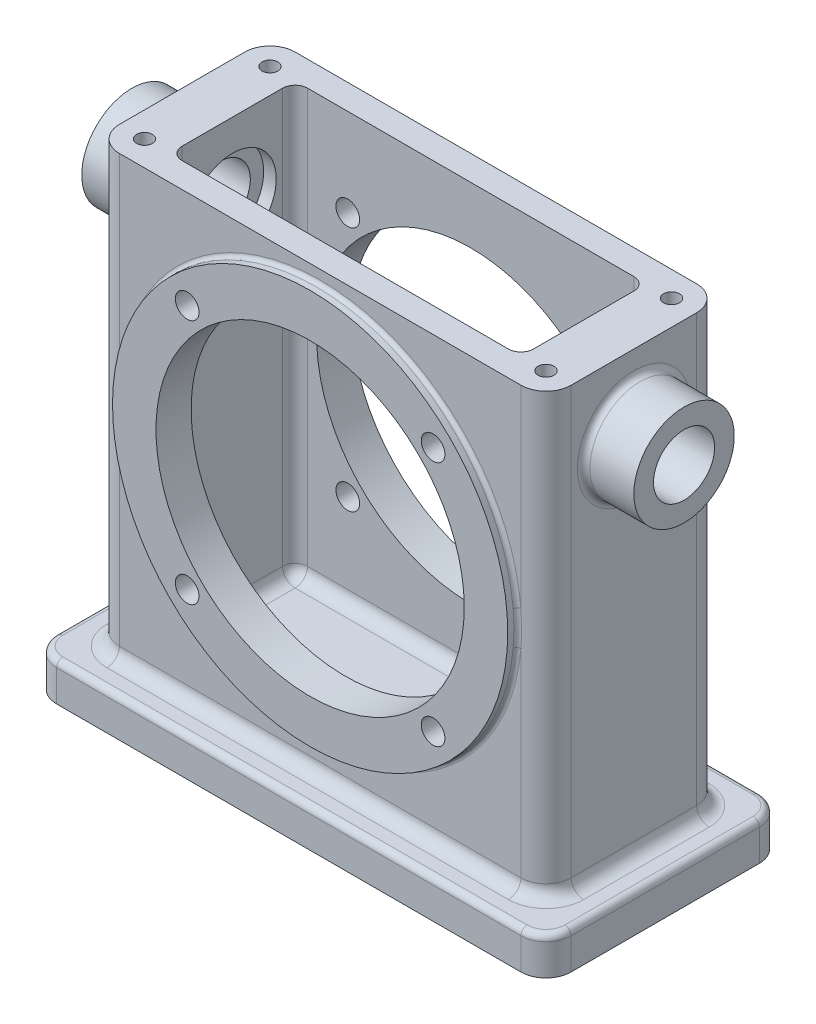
from build123d import *

# Parameters (mm, degrees)
SKETCH1_W           = 130.175
SKETCH1_H           = 60.325
BASE_EXTRUDE_DEPTH  = 9.525
SKETCH2_W           = 114.3
SKETCH2_H           = 44.45
BOSS_EXTRUDE1_DEPTH = 111.125
FILLET1_R           = 6.35
FILLET2_R           = 1.5875
FILLET3_R           = 3.175
CUT_EXTRUDE1_DEPTH  = 107.95
FILLET4_R           = 3.175
SKETCH4_R           = 50
BOSS_EXTRUDE2_DEPTH = 2.54
SKETCH5_R           = 39
CUT_EXTRUDE2_DEPTH  = 148.681533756
FILLET5_R           = 0.9906
SKETCH6_R           = 12.7
BOSS_EXTRUDE3_DEPTH = 12.7
SKETCH7_R           = 7.7343
CUT_EXTRUDE3_DEPTH  = 166.724659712
SKETCH8_R           = 11.1125
CUT_EXTRUDE4_DEPTH  = 3.175
FILLET6_R           = 1.5875
SKETCH9_R           = 3
CUT_EXTRUDE5_DEPTH  = 150.841500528
CIRPATTERN1_COUNT   = 4
SKETCH10_R          = 2
CUT_EXTRUDE6_DEPTH  = 19.05


with BuildPart() as part:
    # Sketch1 → Base-Extrude (new body)
    with BuildSketch(Plane(origin=(0, 0, 0), x_dir=(1, 0, 0), z_dir=(0, 1, 0))):
        Rectangle(SKETCH1_W, SKETCH1_H)
    extrude(amount=BASE_EXTRUDE_DEPTH)

    # Sketch2 → Boss-Extrude1 (add)
    with BuildSketch(Plane(origin=(0, 9.525, 0), x_dir=(-1, 0, 0), z_dir=(0, 1, 0))):
        Rectangle(SKETCH2_W, SKETCH2_H)
    extrude(amount=BOSS_EXTRUDE1_DEPTH)

    # Fillet1
    fillet1_edges = [part.edges().sort_by_distance(p)[0] for p in [
        (-57.15, 65.0875, -22.225),
        (-57.15, 65.0875, 22.225),
        (57.15, 65.0875, 22.225),
        (57.15, 65.0875, -22.225),
        (-65.0875, 4.7625, -30.1625),
        (65.0875, 4.7625, -30.1625),
        (65.0875, 4.7625, 30.1625),
        (-65.0875, 4.7625, 30.1625),
    ]]
    fillet(fillet1_edges, radius=FILLET1_R)

    # Fillet2
    fillet2_edges = [part.edges().sort_by_distance(p)[0] for p in [
        (0, 9.525, 30.1625),
        (-65.0875, 9.525, 0),
        (65.0875, 9.525, 0),
        (0, 9.525, -30.1625),
        (-63.227628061, 9.525, -28.302628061),
        (63.227628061, 9.525, 28.302628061),
        (63.227628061, 9.525, -28.302628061),
        (-63.227628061, 9.525, 28.302628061),
    ]]
    fillet(fillet2_edges, radius=FILLET2_R)

    # Fillet3
    fillet3_edges = [part.edges().sort_by_distance(p)[0] for p in [
        (-57.15, 9.525, 0),
        (0, 9.525, -22.225),
        (57.15, 9.525, 0),
        (0, 9.525, 22.225),
        (-55.290128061, 9.525, 20.365128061),
        (-55.290128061, 9.525, -20.365128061),
        (55.290128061, 9.525, 20.365128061),
        (55.290128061, 9.525, -20.365128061),
    ]]
    fillet(fillet3_edges, radius=FILLET3_R)

    # Sketch3 → Cut-Extrude1 (cut)
    with BuildSketch(Plane(origin=(0, 120.65, 0), x_dir=(-1, 0, 0), z_dir=(0, 1, 0))):
        with BuildLine():
            Line((41.275, 15.875), (-41.275, 15.875))
            ThreePointArc((-41.275, 15.875), (-43.52006403, 14.94506403), (-44.45, 12.7))
            Line((-44.45, 12.7), (-44.45, -12.7))
            ThreePointArc((-44.45, -12.7), (-43.52006403, -14.94506403), (-41.275, -15.875))
            Line((-41.275, -15.875), (41.275, -15.875))
            ThreePointArc((41.275, -15.875), (43.52006403, -14.94506403), (44.45, -12.7))
            Line((44.45, -12.7), (44.45, 12.7))
            ThreePointArc((44.45, 12.7), (43.52006403, 14.94506403), (41.275, 15.875))
        make_face()
    extrude(amount=-CUT_EXTRUDE1_DEPTH, mode=Mode.SUBTRACT)

    # Fillet4
    fillet4_edges = [part.edges().sort_by_distance(p)[0] for p in [
        (43.52006403, 12.7, 14.94506403),
        (0, 12.7, 15.875),
        (-43.52006403, 12.7, 14.94506403),
        (-44.45, 12.7, 0),
        (-43.52006403, 12.7, -14.94506403),
        (0, 12.7, -15.875),
        (43.52006403, 12.7, -14.94506403),
        (44.45, 12.7, 0),
    ]]
    fillet(fillet4_edges, radius=FILLET4_R)

    # Sketch4 → Boss-Extrude2 (add)
    with BuildSketch(Plane.XY.offset(22.225)):
        with Locations(Location((0, 67.31, 0), (0, 0, 180))):
            Circle(SKETCH4_R)
    boss_extrude2 = extrude(amount=BOSS_EXTRUDE2_DEPTH)

    # Mirror1: Boss-Extrude2 across plane
    add(boss_extrude2.mirror(Plane.XY))

    # Sketch5 → Cut-Extrude2 (cut, through all)
    with BuildSketch(Plane.XY.offset(24.765)):
        with Locations((0, 67.31)):
            Circle(SKETCH5_R)
    extrude(amount=-CUT_EXTRUDE2_DEPTH, mode=Mode.SUBTRACT)

    # Fillet5
    fillet5_edges = [part.edges().sort_by_distance(p)[0] for p in [
        (50, 67.31, 22.225),
        (50, 67.31, -22.225),
    ]]
    fillet(fillet5_edges, radius=FILLET5_R)

    # Sketch6 → Boss-Extrude3 (add)
    with BuildSketch(Plane(origin=(57.15, 0, 0), x_dir=(0, 0, -1), z_dir=(1, 0, 0))):
        with Locations(Location((0, 101.6, 0), (0, 0, 180))):
            Circle(SKETCH6_R)
    boss_extrude3 = extrude(amount=BOSS_EXTRUDE3_DEPTH)

    # Sketch7 → Cut-Extrude3 (cut, through all)
    with BuildSketch(Plane.ZY.offset(-44.45)):
        with Locations((0, 101.6)):
            Circle(SKETCH7_R)
    cut_extrude3 = extrude(amount=-CUT_EXTRUDE3_DEPTH, mode=Mode.SUBTRACT)

    # Sketch8 → Cut-Extrude4 (cut)
    with BuildSketch(Plane.ZY.offset(-44.45)):
        with Locations((0, 101.6)):
            Circle(SKETCH8_R)
    cut_extrude4 = extrude(amount=-CUT_EXTRUDE4_DEPTH, mode=Mode.SUBTRACT)

    # Mirror3: Boss-Extrude3, Cut-Extrude3, Cut-Extrude4 across plane
    add(boss_extrude3.mirror(Plane(origin=(0, 0, 0), x_dir=(0, 0, 1), z_dir=(1, 0, 0))))
    add(cut_extrude3.mirror(Plane(origin=(0, 0, 0), x_dir=(0, 0, 1), z_dir=(1, 0, 0))), mode=Mode.SUBTRACT)
    add(cut_extrude4.mirror(Plane(origin=(0, 0, 0), x_dir=(0, 0, 1), z_dir=(1, 0, 0))), mode=Mode.SUBTRACT)

    # Fillet6
    fillet6_edges = [part.edges().sort_by_distance(p)[0] for p in [
        (57.15, 101.6, -12.7),
        (-57.15, 101.6, -12.7),
    ]]
    fillet(fillet6_edges, radius=FILLET6_R)

    # Sketch9 → Cut-Extrude5 (cut, through all)
    with BuildSketch(Plane.XY.offset(24.765)):
        with Locations((31.112698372, 98.422698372)):
            Circle(SKETCH9_R)
    cut_extrude5 = extrude(amount=-CUT_EXTRUDE5_DEPTH, mode=Mode.SUBTRACT)

    # CirPattern1: Cut-Extrude5 ×4 about axis
    cirpattern1_axis = Axis((0, 67.31, 0), (0, 0, 1))
    for i in range(1, CIRPATTERN1_COUNT):
        add(cut_extrude5.rotate(cirpattern1_axis, i * 360 / CIRPATTERN1_COUNT), mode=Mode.SUBTRACT)

    # Sketch10 → Cut-Extrude6 (cut)
    with BuildSketch(Plane(origin=(0, 120.65, 0), x_dir=(-1, 0, 0), z_dir=(0, 1, 0))):
        with Locations(Location((-50.8, -15.875, 0), (0, 0, 90))):
            Circle(SKETCH10_R)
        with Locations(Location((-50.8, 15.875, 0), (0, 0, 90))):
            Circle(SKETCH10_R)
    cut_extrude6 = extrude(amount=-CUT_EXTRUDE6_DEPTH, mode=Mode.SUBTRACT)

    # Mirror4: Cut-Extrude6 across plane
    add(cut_extrude6.mirror(Plane(origin=(0, 0, 0), x_dir=(0, 0, 1), z_dir=(1, 0, 0))), mode=Mode.SUBTRACT)


solid = part.part
